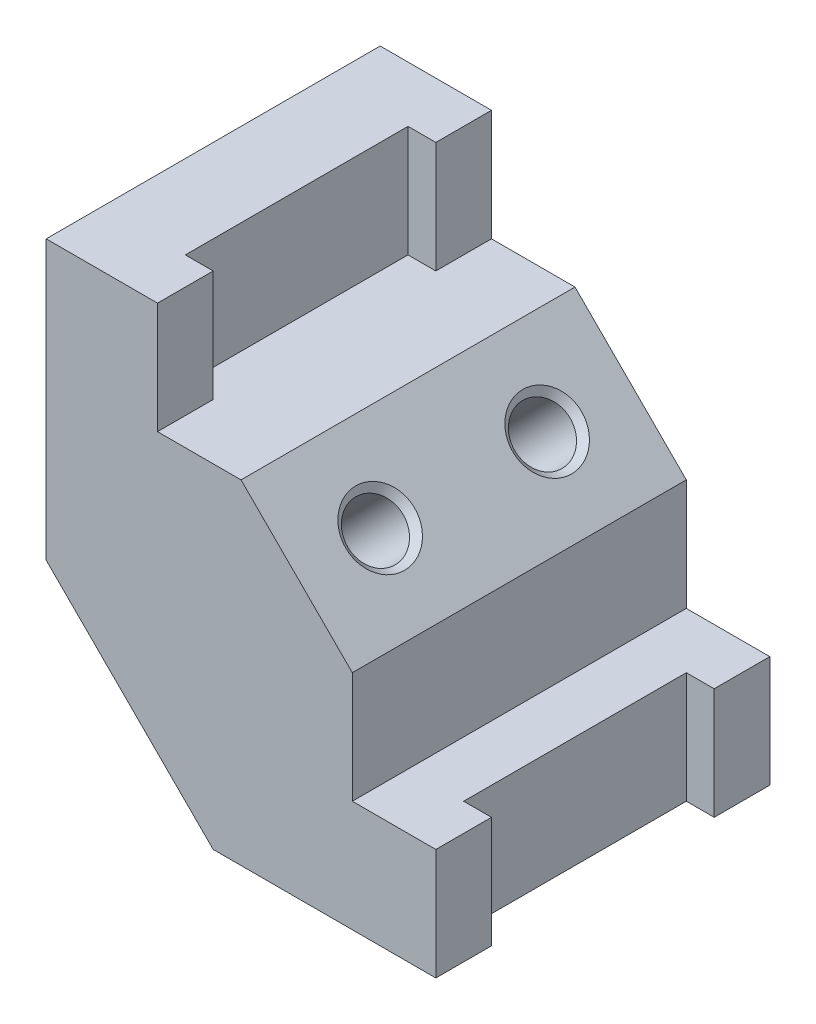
ISO-10303-21;
HEADER;
FILE_DESCRIPTION(('STEP AP214'),'2;1');
FILE_NAME('part.step','',(''),(''),'','','');
FILE_SCHEMA(('AUTOMOTIVE_DESIGN { 1 0 10303 214 1 1 1 1 }'));
ENDSEC;
DATA;
#1=APPLICATION_CONTEXT('core data for automotive mechanical design processes');
#2=APPLICATION_PROTOCOL_DEFINITION('international standard','automotive_design',2000,#1);
#3=PRODUCT_CONTEXT('',#1,'mechanical');
#4=PRODUCT('Part','Part','',(#3));
#5=PRODUCT_RELATED_PRODUCT_CATEGORY('part','',(#4));
#6=PRODUCT_DEFINITION_FORMATION('','',#4);
#7=PRODUCT_DEFINITION_CONTEXT('part definition',#1,'design');
#8=PRODUCT_DEFINITION('design','',#6,#7);
#9=PRODUCT_DEFINITION_SHAPE('','',#8);
#10=(LENGTH_UNIT() NAMED_UNIT(*) SI_UNIT(.MILLI.,.METRE.));
#11=(NAMED_UNIT(*) PLANE_ANGLE_UNIT() SI_UNIT($,.RADIAN.));
#12=(NAMED_UNIT(*) SI_UNIT($,.STERADIAN.) SOLID_ANGLE_UNIT());
#13=UNCERTAINTY_MEASURE_WITH_UNIT(LENGTH_MEASURE(1.E-05),#10,'distance_accuracy_value','');
#14=(GEOMETRIC_REPRESENTATION_CONTEXT(3) GLOBAL_UNCERTAINTY_ASSIGNED_CONTEXT((#13)) GLOBAL_UNIT_ASSIGNED_CONTEXT((#10,
#11,#12)) REPRESENTATION_CONTEXT('',''));
#15=CARTESIAN_POINT('',(0.,0.,0.));
#16=DIRECTION('',(0.,0.,1.));
#17=DIRECTION('',(1.,0.,0.));
#18=AXIS2_PLACEMENT_3D('',#15,#16,#17);
#19=CARTESIAN_POINT('',(88.9,-76.2,38.1));
#20=DIRECTION('',(-1.,0.,0.));
#21=DIRECTION('',(0.,0.,1.));
#22=AXIS2_PLACEMENT_3D('',#19,#20,#21);
#23=PLANE('',#22);
#24=DIRECTION('',(0.,0.,-1.));
#25=VECTOR('',#24,1.);
#26=CARTESIAN_POINT('',(88.9,-76.2,38.1));
#27=LINE('',#26,#25);
#28=CARTESIAN_POINT('',(88.9,-76.2,-25.4));
#29=VERTEX_POINT('',#28);
#30=CARTESIAN_POINT('',(88.9,-76.2,-38.1));
#31=VERTEX_POINT('',#30);
#32=EDGE_CURVE('E280',#29,#31,#27,.T.);
#33=ORIENTED_EDGE('',*,*,#32,.F.);
#34=DIRECTION('',(0.,1.,0.));
#35=VECTOR('',#34,1.);
#36=CARTESIAN_POINT('',(88.9,-101.6,-25.4));
#37=LINE('',#36,#35);
#38=CARTESIAN_POINT('',(88.9,-101.6,-25.4));
#39=VERTEX_POINT('',#38);
#40=EDGE_CURVE('E191',#39,#29,#37,.T.);
#41=ORIENTED_EDGE('',*,*,#40,.F.);
#42=DIRECTION('',(0.,0.,-1.));
#43=VECTOR('',#42,1.);
#44=CARTESIAN_POINT('',(88.9,-101.6,38.1));
#45=LINE('',#44,#43);
#46=CARTESIAN_POINT('',(88.9,-101.6,-38.1));
#47=VERTEX_POINT('',#46);
#48=EDGE_CURVE('E284',#39,#47,#45,.T.);
#49=ORIENTED_EDGE('',*,*,#48,.T.);
#50=DIRECTION('',(0.,1.,0.));
#51=VECTOR('',#50,1.);
#52=CARTESIAN_POINT('',(88.9,-76.2,-38.1));
#53=LINE('',#52,#51);
#54=EDGE_CURVE('E257',#47,#31,#53,.T.);
#55=ORIENTED_EDGE('',*,*,#54,.T.);
#56=EDGE_LOOP('',(#33,#41,#49,#55));
#57=FACE_BOUND('',#56,.T.);
#58=ADVANCED_FACE('F33',(#57),#23,.F.);
#59=CARTESIAN_POINT('',(25.4,0.,38.1));
#60=DIRECTION('',(-1.,0.,0.));
#61=DIRECTION('',(0.,-1.,0.));
#62=AXIS2_PLACEMENT_3D('',#59,#60,#61);
#63=PLANE('',#62);
#64=DIRECTION('',(0.,0.,-1.));
#65=VECTOR('',#64,1.);
#66=CARTESIAN_POINT('',(25.4,-25.4,38.1));
#67=LINE('',#66,#65);
#68=CARTESIAN_POINT('',(25.4,-25.4,38.1));
#69=VERTEX_POINT('',#68);
#70=CARTESIAN_POINT('',(25.4,-25.4,25.4));
#71=VERTEX_POINT('',#70);
#72=EDGE_CURVE('E268',#69,#71,#67,.T.);
#73=ORIENTED_EDGE('',*,*,#72,.T.);
#74=DIRECTION('',(0.,1.,0.));
#75=VECTOR('',#74,1.);
#76=CARTESIAN_POINT('',(25.4,-25.4,25.4));
#77=LINE('',#76,#75);
#78=CARTESIAN_POINT('',(25.4,0.,25.4));
#79=VERTEX_POINT('',#78);
#80=EDGE_CURVE('E201',#71,#79,#77,.T.);
#81=ORIENTED_EDGE('',*,*,#80,.T.);
#82=DIRECTION('',(0.,0.,-1.));
#83=VECTOR('',#82,1.);
#84=CARTESIAN_POINT('',(25.4,0.,38.1));
#85=LINE('',#84,#83);
#86=CARTESIAN_POINT('',(25.4,0.,38.1));
#87=VERTEX_POINT('',#86);
#88=EDGE_CURVE('E297',#87,#79,#85,.T.);
#89=ORIENTED_EDGE('',*,*,#88,.F.);
#90=DIRECTION('',(0.,1.,0.));
#91=VECTOR('',#90,1.);
#92=CARTESIAN_POINT('',(25.4,0.,38.1));
#93=LINE('',#92,#91);
#94=EDGE_CURVE('E223',#69,#87,#93,.T.);
#95=ORIENTED_EDGE('',*,*,#94,.F.);
#96=EDGE_LOOP('',(#73,#81,#89,#95));
#97=FACE_BOUND('',#96,.T.);
#98=ADVANCED_FACE('F382',(#97),#63,.F.);
#99=CARTESIAN_POINT('',(25.4,0.,-25.4));
#100=VERTEX_POINT('',#99);
#101=CARTESIAN_POINT('',(25.4,0.,-38.1));
#102=VERTEX_POINT('',#101);
#103=EDGE_CURVE('E296',#100,#102,#85,.T.);
#104=ORIENTED_EDGE('',*,*,#103,.F.);
#105=DIRECTION('',(0.,1.,0.));
#106=VECTOR('',#105,1.);
#107=CARTESIAN_POINT('',(25.4,-25.4,-25.4));
#108=LINE('',#107,#106);
#109=CARTESIAN_POINT('',(25.4,-25.4,-25.4));
#110=VERTEX_POINT('',#109);
#111=EDGE_CURVE('E213',#110,#100,#108,.T.);
#112=ORIENTED_EDGE('',*,*,#111,.F.);
#113=CARTESIAN_POINT('',(25.4,-25.4,-38.1));
#114=VERTEX_POINT('',#113);
#115=EDGE_CURVE('E245',#110,#114,#67,.T.);
#116=ORIENTED_EDGE('',*,*,#115,.T.);
#117=DIRECTION('',(0.,1.,0.));
#118=VECTOR('',#117,1.);
#119=CARTESIAN_POINT('',(25.4,0.,-38.1));
#120=LINE('',#119,#118);
#121=EDGE_CURVE('E222',#114,#102,#120,.T.);
#122=ORIENTED_EDGE('',*,*,#121,.T.);
#123=EDGE_LOOP('',(#104,#112,#116,#122));
#124=FACE_BOUND('',#123,.T.);
#125=ADVANCED_FACE('F366',(#124),#63,.F.);
#126=CARTESIAN_POINT('',(25.4,0.,38.1));
#127=DIRECTION('',(0.,-1.,0.));
#128=DIRECTION('',(0.,0.,-1.));
#129=AXIS2_PLACEMENT_3D('',#126,#127,#128);
#130=PLANE('',#129);
#131=ORIENTED_EDGE('',*,*,#88,.T.);
#132=DIRECTION('',(1.,0.,0.));
#133=VECTOR('',#132,1.);
#134=CARTESIAN_POINT('',(19.05,0.,25.4));
#135=LINE('',#134,#133);
#136=CARTESIAN_POINT('',(19.05,0.,25.4));
#137=VERTEX_POINT('',#136);
#138=EDGE_CURVE('E190',#137,#79,#135,.T.);
#139=ORIENTED_EDGE('',*,*,#138,.F.);
#140=DIRECTION('',(0.,0.,1.));
#141=VECTOR('',#140,1.);
#142=CARTESIAN_POINT('',(19.05,0.,25.4));
#143=LINE('',#142,#141);
#144=CARTESIAN_POINT('',(19.05,0.,-25.4));
#145=VERTEX_POINT('',#144);
#146=EDGE_CURVE('E196',#145,#137,#143,.T.);
#147=ORIENTED_EDGE('',*,*,#146,.F.);
#148=DIRECTION('',(-1.,0.,0.));
#149=VECTOR('',#148,1.);
#150=CARTESIAN_POINT('',(25.4,0.,-25.4));
#151=LINE('',#150,#149);
#152=EDGE_CURVE('E203',#100,#145,#151,.T.);
#153=ORIENTED_EDGE('',*,*,#152,.F.);
#154=ORIENTED_EDGE('',*,*,#103,.T.);
#155=DIRECTION('',(-1.,0.,0.));
#156=VECTOR('',#155,1.);
#157=CARTESIAN_POINT('',(25.4,0.,-38.1));
#158=LINE('',#157,#156);
#159=CARTESIAN_POINT('',(0.,0.,-38.1));
#160=VERTEX_POINT('',#159);
#161=EDGE_CURVE('E248',#102,#160,#158,.T.);
#162=ORIENTED_EDGE('',*,*,#161,.T.);
#163=DIRECTION('',(0.,0.,-1.));
#164=VECTOR('',#163,1.);
#165=CARTESIAN_POINT('',(0.,0.,38.1));
#166=LINE('',#165,#164);
#167=CARTESIAN_POINT('',(0.,0.,38.1));
#168=VERTEX_POINT('',#167);
#169=EDGE_CURVE('E293',#168,#160,#166,.T.);
#170=ORIENTED_EDGE('',*,*,#169,.F.);
#171=DIRECTION('',(-1.,0.,0.));
#172=VECTOR('',#171,1.);
#173=CARTESIAN_POINT('',(25.4,0.,38.1));
#174=LINE('',#173,#172);
#175=EDGE_CURVE('E226',#87,#168,#174,.T.);
#176=ORIENTED_EDGE('',*,*,#175,.F.);
#177=EDGE_LOOP('',(#131,#139,#147,#153,#154,#162,#170,#176));
#178=FACE_BOUND('',#177,.T.);
#179=ADVANCED_FACE('F384',(#178),#130,.F.);
#180=CARTESIAN_POINT('',(0.,0.,38.1));
#181=DIRECTION('',(1.,0.,0.));
#182=DIRECTION('',(0.,1.,0.));
#183=AXIS2_PLACEMENT_3D('',#180,#181,#182);
#184=PLANE('',#183);
#185=DIRECTION('',(0.,-1.,0.));
#186=VECTOR('',#185,1.);
#187=CARTESIAN_POINT('',(0.,0.,-38.1));
#188=LINE('',#187,#186);
#189=CARTESIAN_POINT('',(0.,-63.5000000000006,-38.1));
#190=VERTEX_POINT('',#189);
#191=EDGE_CURVE('E250',#160,#190,#188,.T.);
#192=ORIENTED_EDGE('',*,*,#191,.T.);
#193=DIRECTION('',(0.,0.,-1.));
#194=VECTOR('',#193,1.);
#195=CARTESIAN_POINT('',(0.,-63.5000000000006,38.1));
#196=LINE('',#195,#194);
#197=CARTESIAN_POINT('',(0.,-63.5000000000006,38.1));
#198=VERTEX_POINT('',#197);
#199=EDGE_CURVE('E290',#198,#190,#196,.T.);
#200=ORIENTED_EDGE('',*,*,#199,.F.);
#201=DIRECTION('',(0.,-1.,0.));
#202=VECTOR('',#201,1.);
#203=CARTESIAN_POINT('',(0.,0.,38.1));
#204=LINE('',#203,#202);
#205=EDGE_CURVE('E229',#168,#198,#204,.T.);
#206=ORIENTED_EDGE('',*,*,#205,.F.);
#207=ORIENTED_EDGE('',*,*,#169,.T.);
#208=EDGE_LOOP('',(#192,#200,#206,#207));
#209=FACE_BOUND('',#208,.T.);
#210=ADVANCED_FACE('F327',(#209),#184,.F.);
#211=CARTESIAN_POINT('',(0.,-63.5000000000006,38.1));
#212=DIRECTION('',(0.707106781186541,0.707106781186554,0.));
#213=DIRECTION('',(-0.707106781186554,0.707106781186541,0.));
#214=AXIS2_PLACEMENT_3D('',#211,#212,#213);
#215=PLANE('',#214);
#216=CARTESIAN_POINT('',(15.8769178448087,-79.376917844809,-19.05));
#217=DIRECTION('',(0.707106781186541,0.707106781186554,0.));
#218=DIRECTION('',(-0.707106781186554,0.707106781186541,0.));
#219=AXIS2_PLACEMENT_3D('',#216,#217,#218);
#220=CIRCLE('',#219,6.35);
#221=CARTESIAN_POINT('',(11.3867897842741,-74.8867897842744,-19.05));
#222=VERTEX_POINT('',#221);
#223=EDGE_CURVE('E210',#222,#222,#220,.T.);
#224=ORIENTED_EDGE('',*,*,#223,.T.);
#225=EDGE_LOOP('',(#224));
#226=FACE_BOUND('',#225,.T.);
#227=CARTESIAN_POINT('',(15.8769178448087,-79.376917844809,19.05));
#228=DIRECTION('',(0.707106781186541,0.707106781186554,0.));
#229=DIRECTION('',(-0.707106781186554,0.707106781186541,0.));
#230=AXIS2_PLACEMENT_3D('',#227,#228,#229);
#231=CIRCLE('',#230,6.35);
#232=CARTESIAN_POINT('',(11.3867897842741,-74.8867897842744,19.05));
#233=VERTEX_POINT('',#232);
#234=EDGE_CURVE('E219',#233,#233,#231,.T.);
#235=ORIENTED_EDGE('',*,*,#234,.T.);
#236=EDGE_LOOP('',(#235));
#237=FACE_BOUND('',#236,.T.);
#238=DIRECTION('',(0.707106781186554,-0.707106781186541,0.));
#239=VECTOR('',#238,1.);
#240=CARTESIAN_POINT('',(0.,-63.5000000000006,-38.1));
#241=LINE('',#240,#239);
#242=CARTESIAN_POINT('',(38.1000000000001,-101.6,-38.1));
#243=VERTEX_POINT('',#242);
#244=EDGE_CURVE('E252',#190,#243,#241,.T.);
#245=ORIENTED_EDGE('',*,*,#244,.T.);
#246=DIRECTION('',(0.,0.,-1.));
#247=VECTOR('',#246,1.);
#248=CARTESIAN_POINT('',(38.1000000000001,-101.6,38.1));
#249=LINE('',#248,#247);
#250=CARTESIAN_POINT('',(38.1000000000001,-101.6,38.1));
#251=VERTEX_POINT('',#250);
#252=EDGE_CURVE('E287',#251,#243,#249,.T.);
#253=ORIENTED_EDGE('',*,*,#252,.F.);
#254=DIRECTION('',(0.707106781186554,-0.707106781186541,0.));
#255=VECTOR('',#254,1.);
#256=CARTESIAN_POINT('',(0.,-63.5000000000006,38.1));
#257=LINE('',#256,#255);
#258=EDGE_CURVE('E231',#198,#251,#257,.T.);
#259=ORIENTED_EDGE('',*,*,#258,.F.);
#260=ORIENTED_EDGE('',*,*,#199,.T.);
#261=EDGE_LOOP('',(#245,#253,#259,#260));
#262=FACE_BOUND('',#261,.T.);
#263=ADVANCED_FACE('F324',(#226,#237,#262),#215,.F.);
#264=CARTESIAN_POINT('',(88.9,-101.6,38.1));
#265=DIRECTION('',(0.,1.,0.));
#266=DIRECTION('',(0.,0.,1.));
#267=AXIS2_PLACEMENT_3D('',#264,#265,#266);
#268=PLANE('',#267);
#269=ORIENTED_EDGE('',*,*,#48,.F.);
#270=DIRECTION('',(-1.,0.,0.));
#271=VECTOR('',#270,1.);
#272=CARTESIAN_POINT('',(88.9,-101.6,-25.4));
#273=LINE('',#272,#271);
#274=CARTESIAN_POINT('',(82.55,-101.6,-25.4));
#275=VERTEX_POINT('',#274);
#276=EDGE_CURVE('E167',#39,#275,#273,.T.);
#277=ORIENTED_EDGE('',*,*,#276,.T.);
#278=DIRECTION('',(0.,0.,1.));
#279=VECTOR('',#278,1.);
#280=CARTESIAN_POINT('',(82.55,-101.6,25.4));
#281=LINE('',#280,#279);
#282=CARTESIAN_POINT('',(82.55,-101.6,25.4));
#283=VERTEX_POINT('',#282);
#284=EDGE_CURVE('E162',#275,#283,#281,.T.);
#285=ORIENTED_EDGE('',*,*,#284,.T.);
#286=DIRECTION('',(1.,0.,0.));
#287=VECTOR('',#286,1.);
#288=CARTESIAN_POINT('',(82.55,-101.6,25.4));
#289=LINE('',#288,#287);
#290=CARTESIAN_POINT('',(88.9,-101.6,25.4));
#291=VERTEX_POINT('',#290);
#292=EDGE_CURVE('E170',#283,#291,#289,.T.);
#293=ORIENTED_EDGE('',*,*,#292,.T.);
#294=CARTESIAN_POINT('',(88.9,-101.6,38.1));
#295=VERTEX_POINT('',#294);
#296=EDGE_CURVE('E285',#295,#291,#45,.T.);
#297=ORIENTED_EDGE('',*,*,#296,.F.);
#298=DIRECTION('',(1.,0.,0.));
#299=VECTOR('',#298,1.);
#300=CARTESIAN_POINT('',(88.9,-101.6,38.1));
#301=LINE('',#300,#299);
#302=EDGE_CURVE('E233',#251,#295,#301,.T.);
#303=ORIENTED_EDGE('',*,*,#302,.F.);
#304=ORIENTED_EDGE('',*,*,#252,.T.);
#305=DIRECTION('',(1.,0.,0.));
#306=VECTOR('',#305,1.);
#307=CARTESIAN_POINT('',(88.9,-101.6,-38.1));
#308=LINE('',#307,#306);
#309=EDGE_CURVE('E254',#243,#47,#308,.T.);
#310=ORIENTED_EDGE('',*,*,#309,.T.);
#311=EDGE_LOOP('',(#269,#277,#285,#293,#297,#303,#304,#310));
#312=FACE_BOUND('',#311,.T.);
#313=ADVANCED_FACE('F178',(#312),#268,.F.);
#314=ORIENTED_EDGE('',*,*,#296,.T.);
#315=DIRECTION('',(0.,1.,0.));
#316=VECTOR('',#315,1.);
#317=CARTESIAN_POINT('',(88.9,-101.6,25.4));
#318=LINE('',#317,#316);
#319=CARTESIAN_POINT('',(88.9,-76.2,25.4));
#320=VERTEX_POINT('',#319);
#321=EDGE_CURVE('E166',#291,#320,#318,.T.);
#322=ORIENTED_EDGE('',*,*,#321,.T.);
#323=CARTESIAN_POINT('',(88.9,-76.2,38.1));
#324=VERTEX_POINT('',#323);
#325=EDGE_CURVE('E281',#324,#320,#27,.T.);
#326=ORIENTED_EDGE('',*,*,#325,.F.);
#327=DIRECTION('',(0.,1.,0.));
#328=VECTOR('',#327,1.);
#329=CARTESIAN_POINT('',(88.9,-76.2,38.1));
#330=LINE('',#329,#328);
#331=EDGE_CURVE('E235',#295,#324,#330,.T.);
#332=ORIENTED_EDGE('',*,*,#331,.F.);
#333=EDGE_LOOP('',(#314,#322,#326,#332));
#334=FACE_BOUND('',#333,.T.);
#335=ADVANCED_FACE('F353',(#334),#23,.F.);
#336=CARTESIAN_POINT('',(69.8500000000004,-76.2,38.1));
#337=DIRECTION('',(0.,-1.,0.));
#338=DIRECTION('',(0.,0.,-1.));
#339=AXIS2_PLACEMENT_3D('',#336,#337,#338);
#340=PLANE('',#339);
#341=DIRECTION('',(0.,0.,1.));
#342=VECTOR('',#341,1.);
#343=CARTESIAN_POINT('',(82.55,-76.2,25.4));
#344=LINE('',#343,#342);
#345=CARTESIAN_POINT('',(82.55,-76.2,-25.4));
#346=VERTEX_POINT('',#345);
#347=CARTESIAN_POINT('',(82.55,-76.2,25.4));
#348=VERTEX_POINT('',#347);
#349=EDGE_CURVE('E48',#346,#348,#344,.T.);
#350=ORIENTED_EDGE('',*,*,#349,.F.);
#351=DIRECTION('',(-1.,0.,0.));
#352=VECTOR('',#351,1.);
#353=CARTESIAN_POINT('',(88.9,-76.2,-25.4));
#354=LINE('',#353,#352);
#355=EDGE_CURVE('E179',#29,#346,#354,.T.);
#356=ORIENTED_EDGE('',*,*,#355,.F.);
#357=ORIENTED_EDGE('',*,*,#32,.T.);
#358=DIRECTION('',(-1.,0.,0.));
#359=VECTOR('',#358,1.);
#360=CARTESIAN_POINT('',(69.8500000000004,-76.2,-38.1));
#361=LINE('',#360,#359);
#362=CARTESIAN_POINT('',(69.8500000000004,-76.2,-38.1));
#363=VERTEX_POINT('',#362);
#364=EDGE_CURVE('E260',#31,#363,#361,.T.);
#365=ORIENTED_EDGE('',*,*,#364,.T.);
#366=DIRECTION('',(0.,0.,-1.));
#367=VECTOR('',#366,1.);
#368=CARTESIAN_POINT('',(69.8500000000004,-76.2,38.1));
#369=LINE('',#368,#367);
#370=CARTESIAN_POINT('',(69.8500000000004,-76.2,38.1));
#371=VERTEX_POINT('',#370);
#372=EDGE_CURVE('E277',#371,#363,#369,.T.);
#373=ORIENTED_EDGE('',*,*,#372,.F.);
#374=DIRECTION('',(-1.,0.,0.));
#375=VECTOR('',#374,1.);
#376=CARTESIAN_POINT('',(69.8500000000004,-76.2,38.1));
#377=LINE('',#376,#375);
#378=EDGE_CURVE('E237',#324,#371,#377,.T.);
#379=ORIENTED_EDGE('',*,*,#378,.F.);
#380=ORIENTED_EDGE('',*,*,#325,.T.);
#381=DIRECTION('',(1.,0.,0.));
#382=VECTOR('',#381,1.);
#383=CARTESIAN_POINT('',(82.55,-76.2,25.4));
#384=LINE('',#383,#382);
#385=EDGE_CURVE('E182',#348,#320,#384,.T.);
#386=ORIENTED_EDGE('',*,*,#385,.F.);
#387=EDGE_LOOP('',(#350,#356,#357,#365,#373,#379,#380,#386));
#388=FACE_BOUND('',#387,.T.);
#389=ADVANCED_FACE('F349',(#388),#340,.F.);
#390=CARTESIAN_POINT('',(69.8500000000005,-50.8,38.1));
#391=DIRECTION('',(-1.,0.,0.));
#392=DIRECTION('',(0.,-1.,0.));
#393=AXIS2_PLACEMENT_3D('',#390,#391,#392);
#394=PLANE('',#393);
#395=DIRECTION('',(0.,1.,0.));
#396=VECTOR('',#395,1.);
#397=CARTESIAN_POINT('',(69.8500000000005,-50.8,-38.1));
#398=LINE('',#397,#396);
#399=CARTESIAN_POINT('',(69.8500000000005,-50.8,-38.1));
#400=VERTEX_POINT('',#399);
#401=EDGE_CURVE('E262',#363,#400,#398,.T.);
#402=ORIENTED_EDGE('',*,*,#401,.T.);
#403=DIRECTION('',(0.,0.,-1.));
#404=VECTOR('',#403,1.);
#405=CARTESIAN_POINT('',(69.8500000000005,-50.8,38.1));
#406=LINE('',#405,#404);
#407=CARTESIAN_POINT('',(69.8500000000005,-50.8,38.1));
#408=VERTEX_POINT('',#407);
#409=EDGE_CURVE('E274',#408,#400,#406,.T.);
#410=ORIENTED_EDGE('',*,*,#409,.F.);
#411=DIRECTION('',(0.,1.,0.));
#412=VECTOR('',#411,1.);
#413=CARTESIAN_POINT('',(69.8500000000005,-50.8,38.1));
#414=LINE('',#413,#412);
#415=EDGE_CURVE('E239',#371,#408,#414,.T.);
#416=ORIENTED_EDGE('',*,*,#415,.F.);
#417=ORIENTED_EDGE('',*,*,#372,.T.);
#418=EDGE_LOOP('',(#402,#410,#416,#417));
#419=FACE_BOUND('',#418,.T.);
#420=ADVANCED_FACE('F378',(#419),#394,.F.);
#421=CARTESIAN_POINT('',(44.45,-25.4,38.1));
#422=DIRECTION('',(-0.707106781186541,-0.707106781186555,0.));
#423=DIRECTION('',(0.707106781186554,-0.707106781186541,0.));
#424=AXIS2_PLACEMENT_3D('',#421,#422,#423);
#425=PLANE('',#424);
#426=CARTESIAN_POINT('',(57.1519178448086,-38.1019178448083,19.05));
#427=DIRECTION('',(-0.707106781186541,-0.707106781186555,0.));
#428=DIRECTION('',(0.707106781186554,-0.707106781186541,0.));
#429=AXIS2_PLACEMENT_3D('',#426,#427,#428);
#430=CIRCLE('',#429,7.87399999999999);
#431=CARTESIAN_POINT('',(62.7196766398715,-43.6696766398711,19.05));
#432=VERTEX_POINT('',#431);
#433=EDGE_CURVE('E41',#432,#432,#430,.T.);
#434=ORIENTED_EDGE('',*,*,#433,.T.);
#435=EDGE_LOOP('',(#434));
#436=FACE_BOUND('',#435,.T.);
#437=CARTESIAN_POINT('',(57.1519178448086,-38.1019178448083,-19.05));
#438=DIRECTION('',(-0.707106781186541,-0.707106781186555,0.));
#439=DIRECTION('',(0.707106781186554,-0.707106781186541,0.));
#440=AXIS2_PLACEMENT_3D('',#437,#438,#439);
#441=CIRCLE('',#440,7.87399999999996);
#442=CARTESIAN_POINT('',(62.7196766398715,-43.6696766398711,-19.05));
#443=VERTEX_POINT('',#442);
#444=EDGE_CURVE('E303',#443,#443,#441,.T.);
#445=ORIENTED_EDGE('',*,*,#444,.T.);
#446=EDGE_LOOP('',(#445));
#447=FACE_BOUND('',#446,.T.);
#448=DIRECTION('',(-0.707106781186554,0.70710678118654,0.));
#449=VECTOR('',#448,1.);
#450=CARTESIAN_POINT('',(44.45,-25.4,-38.1));
#451=LINE('',#450,#449);
#452=CARTESIAN_POINT('',(44.45,-25.4,-38.1));
#453=VERTEX_POINT('',#452);
#454=EDGE_CURVE('E264',#400,#453,#451,.T.);
#455=ORIENTED_EDGE('',*,*,#454,.T.);
#456=DIRECTION('',(0.,0.,-1.));
#457=VECTOR('',#456,1.);
#458=CARTESIAN_POINT('',(44.45,-25.4,38.1));
#459=LINE('',#458,#457);
#460=CARTESIAN_POINT('',(44.45,-25.4,38.1));
#461=VERTEX_POINT('',#460);
#462=EDGE_CURVE('E271',#461,#453,#459,.T.);
#463=ORIENTED_EDGE('',*,*,#462,.F.);
#464=DIRECTION('',(-0.707106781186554,0.70710678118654,0.));
#465=VECTOR('',#464,1.);
#466=CARTESIAN_POINT('',(44.45,-25.4,38.1));
#467=LINE('',#466,#465);
#468=EDGE_CURVE('E241',#408,#461,#467,.T.);
#469=ORIENTED_EDGE('',*,*,#468,.F.);
#470=ORIENTED_EDGE('',*,*,#409,.T.);
#471=EDGE_LOOP('',(#455,#463,#469,#470));
#472=FACE_BOUND('',#471,.T.);
#473=ADVANCED_FACE('F308',(#436,#447,#472),#425,.F.);
#474=CARTESIAN_POINT('',(25.4,-25.4,38.1));
#475=DIRECTION('',(0.,-1.,0.));
#476=DIRECTION('',(1.,0.,0.));
#477=AXIS2_PLACEMENT_3D('',#474,#475,#476);
#478=PLANE('',#477);
#479=DIRECTION('',(-1.,0.,0.));
#480=VECTOR('',#479,1.);
#481=CARTESIAN_POINT('',(25.4,-25.4,-38.1));
#482=LINE('',#481,#480);
#483=EDGE_CURVE('E227',#453,#114,#482,.T.);
#484=ORIENTED_EDGE('',*,*,#483,.T.);
#485=ORIENTED_EDGE('',*,*,#115,.F.);
#486=DIRECTION('',(-1.,0.,0.));
#487=VECTOR('',#486,1.);
#488=CARTESIAN_POINT('',(25.4,-25.4,-25.4));
#489=LINE('',#488,#487);
#490=CARTESIAN_POINT('',(19.05,-25.4,-25.4));
#491=VERTEX_POINT('',#490);
#492=EDGE_CURVE('E195',#110,#491,#489,.T.);
#493=ORIENTED_EDGE('',*,*,#492,.T.);
#494=DIRECTION('',(0.,0.,1.));
#495=VECTOR('',#494,1.);
#496=CARTESIAN_POINT('',(19.05,-25.4,25.4));
#497=LINE('',#496,#495);
#498=CARTESIAN_POINT('',(19.05,-25.4,25.4));
#499=VERTEX_POINT('',#498);
#500=EDGE_CURVE('E199',#491,#499,#497,.T.);
#501=ORIENTED_EDGE('',*,*,#500,.T.);
#502=DIRECTION('',(1.,0.,0.));
#503=VECTOR('',#502,1.);
#504=CARTESIAN_POINT('',(19.05,-25.4,25.4));
#505=LINE('',#504,#503);
#506=EDGE_CURVE('E56',#499,#71,#505,.T.);
#507=ORIENTED_EDGE('',*,*,#506,.T.);
#508=ORIENTED_EDGE('',*,*,#72,.F.);
#509=DIRECTION('',(-1.,0.,0.));
#510=VECTOR('',#509,1.);
#511=CARTESIAN_POINT('',(25.4,-25.4,38.1));
#512=LINE('',#511,#510);
#513=EDGE_CURVE('E243',#461,#69,#512,.T.);
#514=ORIENTED_EDGE('',*,*,#513,.F.);
#515=ORIENTED_EDGE('',*,*,#462,.T.);
#516=EDGE_LOOP('',(#484,#485,#493,#501,#507,#508,#514,#515));
#517=FACE_BOUND('',#516,.T.);
#518=ADVANCED_FACE('F369',(#517),#478,.F.);
#519=CARTESIAN_POINT('',(0.,0.,38.1));
#520=DIRECTION('',(0.,0.,1.));
#521=DIRECTION('',(1.,0.,0.));
#522=AXIS2_PLACEMENT_3D('',#519,#520,#521);
#523=PLANE('',#522);
#524=ORIENTED_EDGE('',*,*,#94,.T.);
#525=ORIENTED_EDGE('',*,*,#175,.T.);
#526=ORIENTED_EDGE('',*,*,#205,.T.);
#527=ORIENTED_EDGE('',*,*,#258,.T.);
#528=ORIENTED_EDGE('',*,*,#302,.T.);
#529=ORIENTED_EDGE('',*,*,#331,.T.);
#530=ORIENTED_EDGE('',*,*,#378,.T.);
#531=ORIENTED_EDGE('',*,*,#415,.T.);
#532=ORIENTED_EDGE('',*,*,#468,.T.);
#533=ORIENTED_EDGE('',*,*,#513,.T.);
#534=EDGE_LOOP('',(#524,#525,#526,#527,#528,#529,#530,#531,#532,#533));
#535=FACE_BOUND('',#534,.T.);
#536=ADVANCED_FACE('F356',(#535),#523,.T.);
#537=CARTESIAN_POINT('',(0.,0.,-38.1));
#538=DIRECTION('',(0.,0.,1.));
#539=DIRECTION('',(1.,0.,0.));
#540=AXIS2_PLACEMENT_3D('',#537,#538,#539);
#541=PLANE('',#540);
#542=ORIENTED_EDGE('',*,*,#121,.F.);
#543=ORIENTED_EDGE('',*,*,#483,.F.);
#544=ORIENTED_EDGE('',*,*,#454,.F.);
#545=ORIENTED_EDGE('',*,*,#401,.F.);
#546=ORIENTED_EDGE('',*,*,#364,.F.);
#547=ORIENTED_EDGE('',*,*,#54,.F.);
#548=ORIENTED_EDGE('',*,*,#309,.F.);
#549=ORIENTED_EDGE('',*,*,#244,.F.);
#550=ORIENTED_EDGE('',*,*,#191,.F.);
#551=ORIENTED_EDGE('',*,*,#161,.F.);
#552=EDGE_LOOP('',(#542,#543,#544,#545,#546,#547,#548,#549,#550,#551));
#553=FACE_BOUND('',#552,.T.);
#554=ADVANCED_FACE('F320',(#553),#541,.F.);
#555=CARTESIAN_POINT('',(-3.17308215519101,-98.426917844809,19.05));
#556=DIRECTION('',(0.707106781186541,0.707106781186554,0.));
#557=DIRECTION('',(-0.707106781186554,0.707106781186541,0.));
#558=AXIS2_PLACEMENT_3D('',#555,#556,#557);
#559=CYLINDRICAL_SURFACE('',#558,6.35);
#560=CARTESIAN_POINT('',(56.0742871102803,-39.1795485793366,19.05));
#561=DIRECTION('',(-0.707106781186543,-0.707106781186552,0.));
#562=DIRECTION('',(0.707106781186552,-0.707106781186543,0.));
#563=AXIS2_PLACEMENT_3D('',#560,#561,#562);
#564=CIRCLE('',#563,6.35);
#565=CARTESIAN_POINT('',(51.5841590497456,-34.6894205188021,19.05));
#566=VERTEX_POINT('',#565);
#567=EDGE_CURVE('E300',#566,#566,#564,.F.);
#568=CARTESIAN_POINT('',(51.5841590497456,-34.6894205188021,19.05));
#569=CARTESIAN_POINT('',(51.1654364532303,-35.1081431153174,19.05));
#570=CARTESIAN_POINT('',(50.746713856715,-35.5268657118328,19.05));
#571=CARTESIAN_POINT('',(49.9092686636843,-36.3643109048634,19.05));
#572=CARTESIAN_POINT('',(49.490546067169,-36.7830335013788,19.05));
#573=CARTESIAN_POINT('',(48.6531008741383,-37.6204786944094,19.05));
#574=CARTESIAN_POINT('',(48.234378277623,-38.0392012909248,19.05));
#575=CARTESIAN_POINT('',(47.3969330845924,-38.8766464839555,19.05));
#576=CARTESIAN_POINT('',(46.978210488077,-39.2953690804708,19.05));
#577=CARTESIAN_POINT('',(46.1407652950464,-40.1328142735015,19.05));
#578=CARTESIAN_POINT('',(45.722042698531,-40.5515368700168,19.05));
#579=CARTESIAN_POINT('',(44.8845975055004,-41.3889820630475,19.05));
#580=CARTESIAN_POINT('',(44.4658749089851,-41.8077046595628,19.05));
#581=CARTESIAN_POINT('',(43.6284297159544,-42.6451498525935,19.05));
#582=CARTESIAN_POINT('',(43.2097071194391,-43.0638724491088,19.05));
#583=CARTESIAN_POINT('',(42.3722619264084,-43.9013176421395,19.05));
#584=CARTESIAN_POINT('',(41.9535393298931,-44.3200402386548,19.05));
#585=CARTESIAN_POINT('',(41.1160941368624,-45.1574854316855,19.05));
#586=CARTESIAN_POINT('',(40.6973715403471,-45.5762080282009,19.05));
#587=CARTESIAN_POINT('',(39.8599263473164,-46.4136532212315,19.05));
#588=CARTESIAN_POINT('',(39.4412037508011,-46.8323758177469,19.05));
#589=CARTESIAN_POINT('',(38.6037585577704,-47.6698210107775,19.05));
#590=CARTESIAN_POINT('',(38.1850359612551,-48.0885436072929,19.05));
#591=CARTESIAN_POINT('',(37.3475907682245,-48.9259888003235,19.05));
#592=CARTESIAN_POINT('',(36.9288681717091,-49.3447113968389,19.05));
#593=CARTESIAN_POINT('',(36.0914229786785,-50.1821565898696,19.05));
#594=CARTESIAN_POINT('',(35.6727003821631,-50.6008791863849,19.05));
#595=CARTESIAN_POINT('',(34.8352551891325,-51.4383243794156,19.05));
#596=CARTESIAN_POINT('',(34.4165325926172,-51.8570469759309,19.05));
#597=CARTESIAN_POINT('',(33.5790873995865,-52.6944921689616,19.05));
#598=CARTESIAN_POINT('',(33.1603648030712,-53.1132147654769,19.05));
#599=CARTESIAN_POINT('',(32.3229196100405,-53.9506599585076,19.05));
#600=CARTESIAN_POINT('',(31.9041970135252,-54.3693825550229,19.05));
#601=CARTESIAN_POINT('',(31.0667518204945,-55.2068277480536,19.05));
#602=CARTESIAN_POINT('',(30.6480292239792,-55.6255503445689,19.05));
#603=CARTESIAN_POINT('',(29.8105840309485,-56.4629955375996,19.05));
#604=CARTESIAN_POINT('',(29.3918614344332,-56.8817181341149,19.05));
#605=CARTESIAN_POINT('',(28.5544162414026,-57.7191633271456,19.05));
#606=CARTESIAN_POINT('',(28.1356936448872,-58.137885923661,19.05));
#607=CARTESIAN_POINT('',(27.2982484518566,-58.9753311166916,19.05));
#608=CARTESIAN_POINT('',(26.8795258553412,-59.394053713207,19.05));
#609=CARTESIAN_POINT('',(26.0420806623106,-60.2314989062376,19.05));
#610=CARTESIAN_POINT('',(25.6233580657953,-60.650221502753,19.05));
#611=CARTESIAN_POINT('',(24.7859128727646,-61.4876666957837,19.05));
#612=CARTESIAN_POINT('',(24.3671902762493,-61.906389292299,19.05));
#613=CARTESIAN_POINT('',(23.5297450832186,-62.7438344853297,19.05));
#614=CARTESIAN_POINT('',(23.1110224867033,-63.162557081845,19.05));
#615=CARTESIAN_POINT('',(22.2735772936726,-64.0000022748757,19.05));
#616=CARTESIAN_POINT('',(21.8548546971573,-64.418724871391,19.05));
#617=CARTESIAN_POINT('',(21.0174095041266,-65.2561700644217,19.05));
#618=CARTESIAN_POINT('',(20.5986869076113,-65.674892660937,19.05));
#619=CARTESIAN_POINT('',(19.7612417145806,-66.5123378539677,19.05));
#620=CARTESIAN_POINT('',(19.3425191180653,-66.931060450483,19.05));
#621=CARTESIAN_POINT('',(18.5050739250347,-67.7685056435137,19.05));
#622=CARTESIAN_POINT('',(18.0863513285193,-68.1872282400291,19.05));
#623=CARTESIAN_POINT('',(17.2489061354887,-69.0246734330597,19.05));
#624=CARTESIAN_POINT('',(16.8301835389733,-69.4433960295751,19.05));
#625=CARTESIAN_POINT('',(15.9927383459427,-70.2808412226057,19.05));
#626=CARTESIAN_POINT('',(15.5740157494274,-70.6995638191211,19.05));
#627=CARTESIAN_POINT('',(14.7365705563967,-71.5370090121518,19.05));
#628=CARTESIAN_POINT('',(14.3178479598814,-71.9557316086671,19.05));
#629=CARTESIAN_POINT('',(13.4804027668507,-72.7931768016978,19.05));
#630=CARTESIAN_POINT('',(13.0616801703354,-73.2118993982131,19.05));
#631=CARTESIAN_POINT('',(12.2242349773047,-74.0493445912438,19.05));
#632=CARTESIAN_POINT('',(11.8055123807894,-74.4680671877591,19.05));
#633=CARTESIAN_POINT('',(11.3867897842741,-74.8867897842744,19.05));
#634=B_SPLINE_CURVE_WITH_KNOTS('',3,(#568,#569,#570,#571,#572,#573,#574,#575,#576,#577,#578,
#579,#580,#581,#582,#583,#584,#585,#586,#587,#588,#589,#590,#591,#592,#593,#594,#595,#596,#597,
#598,#599,#600,#601,#602,#603,#604,#605,#606,#607,#608,#609,#610,#611,#612,#613,#614,#615,#616,
#617,#618,#619,#620,#621,#622,#623,#624,#625,#626,#627,#628,#629,#630,#631,#632,#633),
.UNSPECIFIED.,.F.,.F.,(4,2,2,2,2,2,2,2,2,2,2,2,2,2,2,2,2,2,2,2,2,2,2,2,2,2,2,2,2,2,2,2,4),(0.,
1.77648952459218,3.55297904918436,5.32946857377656,7.10595809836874,8.88244762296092,
10.6589371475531,12.4354266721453,14.2119161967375,15.9884057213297,17.7648952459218,
19.541384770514,21.3178742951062,23.0943638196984,24.8708533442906,26.6473428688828,
28.4238323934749,30.2003219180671,31.9768114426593,33.7533009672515,35.5297904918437,
37.3062800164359,39.082769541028,40.8592590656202,42.6357485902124,44.4122381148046,
46.1887276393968,47.965217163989,49.7417066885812,51.5181962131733,53.2946857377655,
55.0711752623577,56.8476647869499),.UNSPECIFIED.);
#635=EDGE_CURVE('BSEAM316',#566,#233,#634,.T.);
#636=ORIENTED_EDGE('',*,*,#567,.T.);
#637=ORIENTED_EDGE('',*,*,#234,.F.);
#638=ORIENTED_EDGE('',*,*,#635,.T.);
#639=ORIENTED_EDGE('',*,*,#635,.F.);
#640=EDGE_LOOP('',(#636,#638,#637,#639));
#641=FACE_BOUND('',#640,.T.);
#642=ADVANCED_FACE('F316',(#641),#559,.F.);
#643=CARTESIAN_POINT('',(-3.17308215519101,-98.426917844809,-19.05));
#644=DIRECTION('',(0.707106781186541,0.707106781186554,0.));
#645=DIRECTION('',(-0.707106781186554,0.707106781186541,0.));
#646=AXIS2_PLACEMENT_3D('',#643,#644,#645);
#647=CYLINDRICAL_SURFACE('',#646,6.35);
#648=CARTESIAN_POINT('',(56.0742871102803,-39.1795485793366,-19.05));
#649=DIRECTION('',(-0.707106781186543,-0.707106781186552,0.));
#650=DIRECTION('',(0.707106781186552,-0.707106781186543,0.));
#651=AXIS2_PLACEMENT_3D('',#648,#649,#650);
#652=CIRCLE('',#651,6.35);
#653=CARTESIAN_POINT('',(51.5841590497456,-34.6894205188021,-19.05));
#654=VERTEX_POINT('',#653);
#655=EDGE_CURVE('E11',#654,#654,#652,.F.);
#656=CARTESIAN_POINT('',(51.5841590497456,-34.6894205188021,-19.05));
#657=CARTESIAN_POINT('',(51.1654364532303,-35.1081431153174,-19.05));
#658=CARTESIAN_POINT('',(50.746713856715,-35.5268657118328,-19.05));
#659=CARTESIAN_POINT('',(49.9092686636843,-36.3643109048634,-19.05));
#660=CARTESIAN_POINT('',(49.490546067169,-36.7830335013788,-19.05));
#661=CARTESIAN_POINT('',(48.6531008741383,-37.6204786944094,-19.05));
#662=CARTESIAN_POINT('',(48.234378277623,-38.0392012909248,-19.05));
#663=CARTESIAN_POINT('',(47.3969330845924,-38.8766464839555,-19.05));
#664=CARTESIAN_POINT('',(46.978210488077,-39.2953690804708,-19.05));
#665=CARTESIAN_POINT('',(46.1407652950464,-40.1328142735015,-19.05));
#666=CARTESIAN_POINT('',(45.722042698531,-40.5515368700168,-19.05));
#667=CARTESIAN_POINT('',(44.8845975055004,-41.3889820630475,-19.05));
#668=CARTESIAN_POINT('',(44.4658749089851,-41.8077046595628,-19.05));
#669=CARTESIAN_POINT('',(43.6284297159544,-42.6451498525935,-19.05));
#670=CARTESIAN_POINT('',(43.2097071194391,-43.0638724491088,-19.05));
#671=CARTESIAN_POINT('',(42.3722619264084,-43.9013176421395,-19.05));
#672=CARTESIAN_POINT('',(41.9535393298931,-44.3200402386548,-19.05));
#673=CARTESIAN_POINT('',(41.1160941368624,-45.1574854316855,-19.05));
#674=CARTESIAN_POINT('',(40.6973715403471,-45.5762080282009,-19.05));
#675=CARTESIAN_POINT('',(39.8599263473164,-46.4136532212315,-19.05));
#676=CARTESIAN_POINT('',(39.4412037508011,-46.8323758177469,-19.05));
#677=CARTESIAN_POINT('',(38.6037585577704,-47.6698210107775,-19.05));
#678=CARTESIAN_POINT('',(38.1850359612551,-48.0885436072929,-19.05));
#679=CARTESIAN_POINT('',(37.3475907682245,-48.9259888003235,-19.05));
#680=CARTESIAN_POINT('',(36.9288681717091,-49.3447113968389,-19.05));
#681=CARTESIAN_POINT('',(36.0914229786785,-50.1821565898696,-19.05));
#682=CARTESIAN_POINT('',(35.6727003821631,-50.6008791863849,-19.05));
#683=CARTESIAN_POINT('',(34.8352551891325,-51.4383243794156,-19.05));
#684=CARTESIAN_POINT('',(34.4165325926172,-51.8570469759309,-19.05));
#685=CARTESIAN_POINT('',(33.5790873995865,-52.6944921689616,-19.05));
#686=CARTESIAN_POINT('',(33.1603648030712,-53.1132147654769,-19.05));
#687=CARTESIAN_POINT('',(32.3229196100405,-53.9506599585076,-19.05));
#688=CARTESIAN_POINT('',(31.9041970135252,-54.3693825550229,-19.05));
#689=CARTESIAN_POINT('',(31.0667518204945,-55.2068277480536,-19.05));
#690=CARTESIAN_POINT('',(30.6480292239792,-55.6255503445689,-19.05));
#691=CARTESIAN_POINT('',(29.8105840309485,-56.4629955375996,-19.05));
#692=CARTESIAN_POINT('',(29.3918614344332,-56.8817181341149,-19.05));
#693=CARTESIAN_POINT('',(28.5544162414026,-57.7191633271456,-19.05));
#694=CARTESIAN_POINT('',(28.1356936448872,-58.137885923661,-19.05));
#695=CARTESIAN_POINT('',(27.2982484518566,-58.9753311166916,-19.05));
#696=CARTESIAN_POINT('',(26.8795258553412,-59.394053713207,-19.05));
#697=CARTESIAN_POINT('',(26.0420806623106,-60.2314989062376,-19.05));
#698=CARTESIAN_POINT('',(25.6233580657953,-60.650221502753,-19.05));
#699=CARTESIAN_POINT('',(24.7859128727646,-61.4876666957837,-19.05));
#700=CARTESIAN_POINT('',(24.3671902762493,-61.906389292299,-19.05));
#701=CARTESIAN_POINT('',(23.5297450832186,-62.7438344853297,-19.05));
#702=CARTESIAN_POINT('',(23.1110224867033,-63.162557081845,-19.05));
#703=CARTESIAN_POINT('',(22.2735772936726,-64.0000022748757,-19.05));
#704=CARTESIAN_POINT('',(21.8548546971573,-64.418724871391,-19.05));
#705=CARTESIAN_POINT('',(21.0174095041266,-65.2561700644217,-19.05));
#706=CARTESIAN_POINT('',(20.5986869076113,-65.674892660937,-19.05));
#707=CARTESIAN_POINT('',(19.7612417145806,-66.5123378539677,-19.05));
#708=CARTESIAN_POINT('',(19.3425191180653,-66.931060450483,-19.05));
#709=CARTESIAN_POINT('',(18.5050739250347,-67.7685056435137,-19.05));
#710=CARTESIAN_POINT('',(18.0863513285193,-68.1872282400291,-19.05));
#711=CARTESIAN_POINT('',(17.2489061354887,-69.0246734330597,-19.05));
#712=CARTESIAN_POINT('',(16.8301835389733,-69.4433960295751,-19.05));
#713=CARTESIAN_POINT('',(15.9927383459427,-70.2808412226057,-19.05));
#714=CARTESIAN_POINT('',(15.5740157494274,-70.6995638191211,-19.05));
#715=CARTESIAN_POINT('',(14.7365705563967,-71.5370090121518,-19.05));
#716=CARTESIAN_POINT('',(14.3178479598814,-71.9557316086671,-19.05));
#717=CARTESIAN_POINT('',(13.4804027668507,-72.7931768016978,-19.05));
#718=CARTESIAN_POINT('',(13.0616801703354,-73.2118993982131,-19.05));
#719=CARTESIAN_POINT('',(12.2242349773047,-74.0493445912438,-19.05));
#720=CARTESIAN_POINT('',(11.8055123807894,-74.4680671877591,-19.05));
#721=CARTESIAN_POINT('',(11.3867897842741,-74.8867897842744,-19.05));
#722=B_SPLINE_CURVE_WITH_KNOTS('',3,(#656,#657,#658,#659,#660,#661,#662,#663,#664,#665,#666,
#667,#668,#669,#670,#671,#672,#673,#674,#675,#676,#677,#678,#679,#680,#681,#682,#683,#684,#685,
#686,#687,#688,#689,#690,#691,#692,#693,#694,#695,#696,#697,#698,#699,#700,#701,#702,#703,#704,
#705,#706,#707,#708,#709,#710,#711,#712,#713,#714,#715,#716,#717,#718,#719,#720,#721),
.UNSPECIFIED.,.F.,.F.,(4,2,2,2,2,2,2,2,2,2,2,2,2,2,2,2,2,2,2,2,2,2,2,2,2,2,2,2,2,2,2,2,4),(0.,
1.77648952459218,3.55297904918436,5.32946857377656,7.10595809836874,8.88244762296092,
10.6589371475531,12.4354266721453,14.2119161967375,15.9884057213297,17.7648952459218,
19.541384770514,21.3178742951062,23.0943638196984,24.8708533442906,26.6473428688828,
28.4238323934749,30.2003219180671,31.9768114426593,33.7533009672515,35.5297904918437,
37.3062800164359,39.082769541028,40.8592590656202,42.6357485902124,44.4122381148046,
46.1887276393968,47.965217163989,49.7417066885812,51.5181962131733,53.2946857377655,
55.0711752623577,56.8476647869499),.UNSPECIFIED.);
#723=EDGE_CURVE('BSEAM319',#654,#222,#722,.T.);
#724=ORIENTED_EDGE('',*,*,#655,.T.);
#725=ORIENTED_EDGE('',*,*,#223,.F.);
#726=ORIENTED_EDGE('',*,*,#723,.T.);
#727=ORIENTED_EDGE('',*,*,#723,.F.);
#728=EDGE_LOOP('',(#724,#726,#725,#727));
#729=FACE_BOUND('',#728,.T.);
#730=ADVANCED_FACE('F319',(#729),#647,.F.);
#731=CARTESIAN_POINT('',(19.05,-25.4,25.4));
#732=DIRECTION('',(0.,0.,1.));
#733=DIRECTION('',(1.,0.,0.));
#734=AXIS2_PLACEMENT_3D('',#731,#732,#733);
#735=PLANE('',#734);
#736=ORIENTED_EDGE('',*,*,#138,.T.);
#737=ORIENTED_EDGE('',*,*,#80,.F.);
#738=ORIENTED_EDGE('',*,*,#506,.F.);
#739=DIRECTION('',(0.,1.,0.));
#740=VECTOR('',#739,1.);
#741=CARTESIAN_POINT('',(19.05,-25.4,25.4));
#742=LINE('',#741,#740);
#743=EDGE_CURVE('E208',#499,#137,#742,.T.);
#744=ORIENTED_EDGE('',*,*,#743,.T.);
#745=EDGE_LOOP('',(#736,#737,#738,#744));
#746=FACE_BOUND('',#745,.T.);
#747=ADVANCED_FACE('F388',(#746),#735,.F.);
#748=CARTESIAN_POINT('',(19.05,-25.4,25.4));
#749=DIRECTION('',(-1.,0.,0.));
#750=DIRECTION('',(0.,0.,1.));
#751=AXIS2_PLACEMENT_3D('',#748,#749,#750);
#752=PLANE('',#751);
#753=ORIENTED_EDGE('',*,*,#146,.T.);
#754=ORIENTED_EDGE('',*,*,#743,.F.);
#755=ORIENTED_EDGE('',*,*,#500,.F.);
#756=DIRECTION('',(0.,1.,0.));
#757=VECTOR('',#756,1.);
#758=CARTESIAN_POINT('',(19.05,-25.4,-25.4));
#759=LINE('',#758,#757);
#760=EDGE_CURVE('E211',#491,#145,#759,.T.);
#761=ORIENTED_EDGE('',*,*,#760,.T.);
#762=EDGE_LOOP('',(#753,#754,#755,#761));
#763=FACE_BOUND('',#762,.T.);
#764=ADVANCED_FACE('F391',(#763),#752,.F.);
#765=CARTESIAN_POINT('',(25.4,-25.4,-25.4));
#766=DIRECTION('',(0.,0.,-1.));
#767=DIRECTION('',(-1.,0.,0.));
#768=AXIS2_PLACEMENT_3D('',#765,#766,#767);
#769=PLANE('',#768);
#770=ORIENTED_EDGE('',*,*,#152,.T.);
#771=ORIENTED_EDGE('',*,*,#760,.F.);
#772=ORIENTED_EDGE('',*,*,#492,.F.);
#773=ORIENTED_EDGE('',*,*,#111,.T.);
#774=EDGE_LOOP('',(#770,#771,#772,#773));
#775=FACE_BOUND('',#774,.T.);
#776=ADVANCED_FACE('F393',(#775),#769,.F.);
#777=CARTESIAN_POINT('',(82.55,-101.6,25.4));
#778=DIRECTION('',(-1.,0.,0.));
#779=DIRECTION('',(0.,0.,1.));
#780=AXIS2_PLACEMENT_3D('',#777,#778,#779);
#781=PLANE('',#780);
#782=ORIENTED_EDGE('',*,*,#349,.T.);
#783=DIRECTION('',(0.,1.,0.));
#784=VECTOR('',#783,1.);
#785=CARTESIAN_POINT('',(82.55,-101.6,25.4));
#786=LINE('',#785,#784);
#787=EDGE_CURVE('E158',#283,#348,#786,.T.);
#788=ORIENTED_EDGE('',*,*,#787,.F.);
#789=ORIENTED_EDGE('',*,*,#284,.F.);
#790=DIRECTION('',(0.,1.,0.));
#791=VECTOR('',#790,1.);
#792=CARTESIAN_POINT('',(82.55,-101.6,-25.4));
#793=LINE('',#792,#791);
#794=EDGE_CURVE('E188',#275,#346,#793,.T.);
#795=ORIENTED_EDGE('',*,*,#794,.T.);
#796=EDGE_LOOP('',(#782,#788,#789,#795));
#797=FACE_BOUND('',#796,.T.);
#798=ADVANCED_FACE('F160',(#797),#781,.F.);
#799=CARTESIAN_POINT('',(88.9,-101.6,-25.4));
#800=DIRECTION('',(0.,0.,-1.));
#801=DIRECTION('',(-1.,0.,0.));
#802=AXIS2_PLACEMENT_3D('',#799,#800,#801);
#803=PLANE('',#802);
#804=ORIENTED_EDGE('',*,*,#355,.T.);
#805=ORIENTED_EDGE('',*,*,#794,.F.);
#806=ORIENTED_EDGE('',*,*,#276,.F.);
#807=ORIENTED_EDGE('',*,*,#40,.T.);
#808=EDGE_LOOP('',(#804,#805,#806,#807));
#809=FACE_BOUND('',#808,.T.);
#810=ADVANCED_FACE('F347',(#809),#803,.F.);
#811=CARTESIAN_POINT('',(82.55,-101.6,25.4));
#812=DIRECTION('',(0.,0.,1.));
#813=DIRECTION('',(1.,0.,0.));
#814=AXIS2_PLACEMENT_3D('',#811,#812,#813);
#815=PLANE('',#814);
#816=ORIENTED_EDGE('',*,*,#385,.T.);
#817=ORIENTED_EDGE('',*,*,#321,.F.);
#818=ORIENTED_EDGE('',*,*,#292,.F.);
#819=ORIENTED_EDGE('',*,*,#787,.T.);
#820=EDGE_LOOP('',(#816,#817,#818,#819));
#821=FACE_BOUND('',#820,.T.);
#822=ADVANCED_FACE('F171',(#821),#815,.F.);
#823=CARTESIAN_POINT('',(56.0742871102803,-39.1795485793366,19.05));
#824=DIRECTION('',(0.707106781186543,0.707106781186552,0.));
#825=DIRECTION('',(-0.707106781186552,0.707106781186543,0.));
#826=AXIS2_PLACEMENT_3D('',#823,#824,#825);
#827=CONICAL_SURFACE('',#826,6.35,0.785398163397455);
#828=ORIENTED_EDGE('',*,*,#433,.F.);
#829=EDGE_LOOP('',(#828));
#830=FACE_BOUND('',#829,.T.);
#831=ORIENTED_EDGE('',*,*,#567,.F.);
#832=EDGE_LOOP('',(#831));
#833=FACE_BOUND('',#832,.T.);
#834=ADVANCED_FACE('F311',(#830,#833),#827,.F.);
#835=CARTESIAN_POINT('',(56.0742871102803,-39.1795485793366,-19.05));
#836=DIRECTION('',(0.707106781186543,0.707106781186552,0.));
#837=DIRECTION('',(-0.707106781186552,0.707106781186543,0.));
#838=AXIS2_PLACEMENT_3D('',#835,#836,#837);
#839=CONICAL_SURFACE('',#838,6.35,0.785398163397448);
#840=ORIENTED_EDGE('',*,*,#444,.F.);
#841=EDGE_LOOP('',(#840));
#842=FACE_BOUND('',#841,.T.);
#843=ORIENTED_EDGE('',*,*,#655,.F.);
#844=EDGE_LOOP('',(#843));
#845=FACE_BOUND('',#844,.T.);
#846=ADVANCED_FACE('F35',(#842,#845),#839,.F.);
#847=CLOSED_SHELL('',(#58,#98,#125,#179,#210,#263,#313,#335,#389,#420,#473,#518,#536,#554,#642,
#730,#747,#764,#776,#798,#810,#822,#834,#846));
#848=MANIFOLD_SOLID_BREP('B2',#847);
#849=ADVANCED_BREP_SHAPE_REPRESENTATION('',(#18,#848),#14);
#850=SHAPE_DEFINITION_REPRESENTATION(#9,#849);
ENDSEC;
END-ISO-10303-21;
